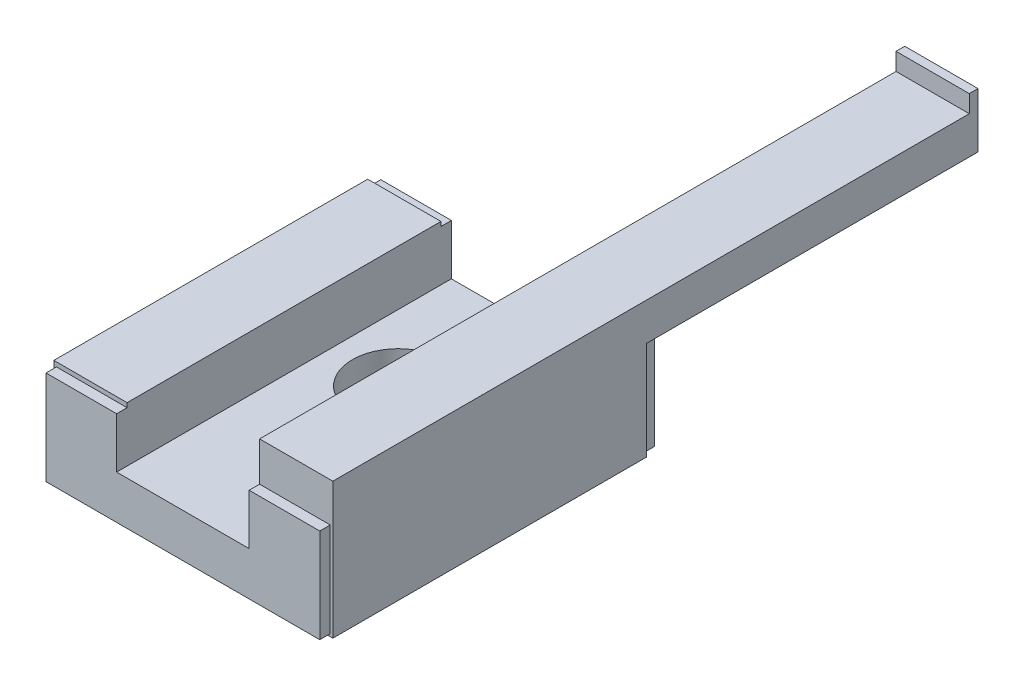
ISO-10303-21;
HEADER;
FILE_DESCRIPTION(('STEP AP214'),'2;1');
FILE_NAME('part.step','',(''),(''),'','','');
FILE_SCHEMA(('AUTOMOTIVE_DESIGN { 1 0 10303 214 1 1 1 1 }'));
ENDSEC;
DATA;
#1=APPLICATION_CONTEXT('core data for automotive mechanical design processes');
#2=APPLICATION_PROTOCOL_DEFINITION('international standard','automotive_design',2000,#1);
#3=PRODUCT_CONTEXT('',#1,'mechanical');
#4=PRODUCT('Part','Part','',(#3));
#5=PRODUCT_RELATED_PRODUCT_CATEGORY('part','',(#4));
#6=PRODUCT_DEFINITION_FORMATION('','',#4);
#7=PRODUCT_DEFINITION_CONTEXT('part definition',#1,'design');
#8=PRODUCT_DEFINITION('design','',#6,#7);
#9=PRODUCT_DEFINITION_SHAPE('','',#8);
#10=(LENGTH_UNIT() NAMED_UNIT(*) SI_UNIT(.MILLI.,.METRE.));
#11=(NAMED_UNIT(*) PLANE_ANGLE_UNIT() SI_UNIT($,.RADIAN.));
#12=(NAMED_UNIT(*) SI_UNIT($,.STERADIAN.) SOLID_ANGLE_UNIT());
#13=UNCERTAINTY_MEASURE_WITH_UNIT(LENGTH_MEASURE(1.E-05),#10,'distance_accuracy_value','');
#14=(GEOMETRIC_REPRESENTATION_CONTEXT(3) GLOBAL_UNCERTAINTY_ASSIGNED_CONTEXT((#13)) GLOBAL_UNIT_ASSIGNED_CONTEXT((#10,
#11,#12)) REPRESENTATION_CONTEXT('',''));
#15=CARTESIAN_POINT('',(0.,0.,0.));
#16=DIRECTION('',(0.,0.,1.));
#17=DIRECTION('',(1.,0.,0.));
#18=AXIS2_PLACEMENT_3D('',#15,#16,#17);
#19=CARTESIAN_POINT('',(7.6,15.6,37.2));
#20=DIRECTION('',(0.,1.,0.));
#21=DIRECTION('',(1.,0.,0.));
#22=AXIS2_PLACEMENT_3D('',#19,#20,#21);
#23=PLANE('',#22);
#24=DIRECTION('',(-1.,0.,0.));
#25=VECTOR('',#24,1.);
#26=CARTESIAN_POINT('',(16.,15.6,-35.8));
#27=LINE('',#26,#25);
#28=CARTESIAN_POINT('',(7.6,15.6,-35.8));
#29=VERTEX_POINT('',#28);
#30=CARTESIAN_POINT('',(16.,15.6,-35.8));
#31=VERTEX_POINT('',#30);
#32=EDGE_CURVE('E197',#29,#31,#27,.F.);
#33=ORIENTED_EDGE('',*,*,#32,.F.);
#34=DIRECTION('',(0.,0.,1.));
#35=VECTOR('',#34,1.);
#36=CARTESIAN_POINT('',(7.6,15.6,-35.8));
#37=LINE('',#36,#35);
#38=CARTESIAN_POINT('',(7.6,15.6,37.2));
#39=VERTEX_POINT('',#38);
#40=EDGE_CURVE('E212',#39,#29,#37,.F.);
#41=ORIENTED_EDGE('',*,*,#40,.F.);
#42=DIRECTION('',(1.,0.,0.));
#43=VECTOR('',#42,1.);
#44=CARTESIAN_POINT('',(7.6,15.6,37.2));
#45=LINE('',#44,#43);
#46=CARTESIAN_POINT('',(16.,15.6,37.2));
#47=VERTEX_POINT('',#46);
#48=EDGE_CURVE('E221',#47,#39,#45,.F.);
#49=ORIENTED_EDGE('',*,*,#48,.F.);
#50=DIRECTION('',(0.,0.,-1.));
#51=VECTOR('',#50,1.);
#52=CARTESIAN_POINT('',(16.,15.6,37.2));
#53=LINE('',#52,#51);
#54=EDGE_CURVE('E214',#47,#31,#53,.T.);
#55=ORIENTED_EDGE('',*,*,#54,.T.);
#56=EDGE_LOOP('',(#33,#41,#49,#55));
#57=FACE_BOUND('',#56,.T.);
#58=ADVANCED_FACE('F16',(#57),#23,.T.);
#59=CARTESIAN_POINT('',(-16.,11.6,37.2));
#60=DIRECTION('',(0.,1.,0.));
#61=DIRECTION('',(1.,0.,0.));
#62=AXIS2_PLACEMENT_3D('',#59,#60,#61);
#63=PLANE('',#62);
#64=DIRECTION('',(1.,0.,0.));
#65=VECTOR('',#64,1.);
#66=CARTESIAN_POINT('',(-16.,11.6,37.2));
#67=LINE('',#66,#65);
#68=CARTESIAN_POINT('',(-7.6,11.6,37.2));
#69=VERTEX_POINT('',#68);
#70=CARTESIAN_POINT('',(-16.,11.6,37.2));
#71=VERTEX_POINT('',#70);
#72=EDGE_CURVE('E232',#69,#71,#67,.F.);
#73=ORIENTED_EDGE('',*,*,#72,.F.);
#74=DIRECTION('',(0.,0.,-1.));
#75=VECTOR('',#74,1.);
#76=CARTESIAN_POINT('',(-7.6,11.6,37.2));
#77=LINE('',#76,#75);
#78=CARTESIAN_POINT('',(-7.6,11.6,1.2));
#79=VERTEX_POINT('',#78);
#80=EDGE_CURVE('E236',#69,#79,#77,.T.);
#81=ORIENTED_EDGE('',*,*,#80,.T.);
#82=DIRECTION('',(-1.,0.,0.));
#83=VECTOR('',#82,1.);
#84=CARTESIAN_POINT('',(-7.6,11.6,1.2));
#85=LINE('',#84,#83);
#86=CARTESIAN_POINT('',(-16.,11.6,1.2));
#87=VERTEX_POINT('',#86);
#88=EDGE_CURVE('E241',#79,#87,#85,.T.);
#89=ORIENTED_EDGE('',*,*,#88,.T.);
#90=DIRECTION('',(0.,0.,1.));
#91=VECTOR('',#90,1.);
#92=CARTESIAN_POINT('',(-16.,11.6,1.2));
#93=LINE('',#92,#91);
#94=EDGE_CURVE('E246',#71,#87,#93,.F.);
#95=ORIENTED_EDGE('',*,*,#94,.F.);
#96=EDGE_LOOP('',(#73,#81,#89,#95));
#97=FACE_BOUND('',#96,.T.);
#98=ADVANCED_FACE('F638',(#97),#63,.T.);
#99=CARTESIAN_POINT('',(-16.,0.,37.2));
#100=DIRECTION('',(-1.,0.,0.));
#101=DIRECTION('',(0.,1.,0.));
#102=AXIS2_PLACEMENT_3D('',#99,#100,#101);
#103=PLANE('',#102);
#104=DIRECTION('',(0.,1.,0.));
#105=VECTOR('',#104,1.);
#106=CARTESIAN_POINT('',(-16.,0.,37.2));
#107=LINE('',#106,#105);
#108=CARTESIAN_POINT('',(-16.,0.,37.2));
#109=VERTEX_POINT('',#108);
#110=EDGE_CURVE('E251',#71,#109,#107,.F.);
#111=ORIENTED_EDGE('',*,*,#110,.F.);
#112=ORIENTED_EDGE('',*,*,#94,.T.);
#113=DIRECTION('',(0.,-1.,0.));
#114=VECTOR('',#113,1.);
#115=CARTESIAN_POINT('',(-16.,11.6,1.2));
#116=LINE('',#115,#114);
#117=CARTESIAN_POINT('',(-16.,0.,1.2));
#118=VERTEX_POINT('',#117);
#119=EDGE_CURVE('E255',#87,#118,#116,.T.);
#120=ORIENTED_EDGE('',*,*,#119,.T.);
#121=DIRECTION('',(0.,0.,1.));
#122=VECTOR('',#121,1.);
#123=CARTESIAN_POINT('',(-16.,0.,1.2));
#124=LINE('',#123,#122);
#125=EDGE_CURVE('E260',#109,#118,#124,.F.);
#126=ORIENTED_EDGE('',*,*,#125,.F.);
#127=EDGE_LOOP('',(#111,#112,#120,#126));
#128=FACE_BOUND('',#127,.T.);
#129=ADVANCED_FACE('F643',(#128),#103,.T.);
#130=CARTESIAN_POINT('',(-16.,0.,1.2));
#131=DIRECTION('',(0.,-1.,0.));
#132=DIRECTION('',(1.,0.,0.));
#133=AXIS2_PLACEMENT_3D('',#130,#131,#132);
#134=PLANE('',#133);
#135=DIRECTION('',(-1.,0.,0.));
#136=VECTOR('',#135,1.);
#137=CARTESIAN_POINT('',(-8.,0.,37.2));
#138=LINE('',#137,#136);
#139=CARTESIAN_POINT('',(-8.,0.,37.2));
#140=VERTEX_POINT('',#139);
#141=EDGE_CURVE('E265',#109,#140,#138,.F.);
#142=ORIENTED_EDGE('',*,*,#141,.F.);
#143=ORIENTED_EDGE('',*,*,#125,.T.);
#144=DIRECTION('',(1.,0.,0.));
#145=VECTOR('',#144,1.);
#146=CARTESIAN_POINT('',(-16.,0.,1.2));
#147=LINE('',#146,#145);
#148=CARTESIAN_POINT('',(-8.,0.,1.2));
#149=VERTEX_POINT('',#148);
#150=EDGE_CURVE('E269',#118,#149,#147,.T.);
#151=ORIENTED_EDGE('',*,*,#150,.T.);
#152=DIRECTION('',(0.,0.,1.));
#153=VECTOR('',#152,1.);
#154=CARTESIAN_POINT('',(-8.,0.,1.2));
#155=LINE('',#154,#153);
#156=EDGE_CURVE('E274',#140,#149,#155,.F.);
#157=ORIENTED_EDGE('',*,*,#156,.F.);
#158=EDGE_LOOP('',(#142,#143,#151,#157));
#159=FACE_BOUND('',#158,.T.);
#160=CARTESIAN_POINT('',(-12.,0.,9.2));
#161=DIRECTION('',(0.,1.,0.));
#162=DIRECTION('',(0.,0.,-1.));
#163=AXIS2_PLACEMENT_3D('',#160,#161,#162);
#164=CIRCLE('',#163,2.);
#165=CARTESIAN_POINT('',(-12.,0.,7.2));
#166=VERTEX_POINT('',#165);
#167=EDGE_CURVE('E279',#166,#166,#164,.F.);
#168=ORIENTED_EDGE('',*,*,#167,.F.);
#169=EDGE_LOOP('',(#168));
#170=FACE_BOUND('',#169,.T.);
#171=CARTESIAN_POINT('',(-12.,0.,29.2));
#172=DIRECTION('',(0.,1.,0.));
#173=DIRECTION('',(0.,0.,-1.));
#174=AXIS2_PLACEMENT_3D('',#171,#172,#173);
#175=CIRCLE('',#174,2.);
#176=CARTESIAN_POINT('',(-12.,0.,27.2));
#177=VERTEX_POINT('',#176);
#178=EDGE_CURVE('E284',#177,#177,#175,.F.);
#179=ORIENTED_EDGE('',*,*,#178,.F.);
#180=EDGE_LOOP('',(#179));
#181=FACE_BOUND('',#180,.T.);
#182=ADVANCED_FACE('F649',(#159,#170,#181),#134,.T.);
#183=CARTESIAN_POINT('',(-7.7,0.300000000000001,1.2));
#184=DIRECTION('',(0.707106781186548,-0.707106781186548,0.));
#185=DIRECTION('',(0.,0.,1.));
#186=AXIS2_PLACEMENT_3D('',#183,#184,#185);
#187=PLANE('',#186);
#188=DIRECTION('',(-0.707106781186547,-0.707106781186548,0.));
#189=VECTOR('',#188,1.);
#190=CARTESIAN_POINT('',(-7.7,0.299999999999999,37.2));
#191=LINE('',#190,#189);
#192=CARTESIAN_POINT('',(-7.7,0.299999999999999,37.2));
#193=VERTEX_POINT('',#192);
#194=EDGE_CURVE('E287',#140,#193,#191,.F.);
#195=ORIENTED_EDGE('',*,*,#194,.F.);
#196=ORIENTED_EDGE('',*,*,#156,.T.);
#197=DIRECTION('',(0.707106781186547,0.707106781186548,0.));
#198=VECTOR('',#197,1.);
#199=CARTESIAN_POINT('',(-8.,0.,1.2));
#200=LINE('',#199,#198);
#201=CARTESIAN_POINT('',(-7.7,0.300000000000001,1.2));
#202=VERTEX_POINT('',#201);
#203=EDGE_CURVE('E289',#149,#202,#200,.T.);
#204=ORIENTED_EDGE('',*,*,#203,.T.);
#205=DIRECTION('',(0.,0.,1.));
#206=VECTOR('',#205,1.);
#207=CARTESIAN_POINT('',(-7.7,0.300000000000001,1.2));
#208=LINE('',#207,#206);
#209=EDGE_CURVE('E294',#193,#202,#208,.F.);
#210=ORIENTED_EDGE('',*,*,#209,.F.);
#211=EDGE_LOOP('',(#195,#196,#204,#210));
#212=FACE_BOUND('',#211,.T.);
#213=ADVANCED_FACE('F653',(#212),#187,.T.);
#214=CARTESIAN_POINT('',(8.,0.,1.2));
#215=DIRECTION('',(-0.707106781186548,-0.707106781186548,0.));
#216=DIRECTION('',(0.,0.,1.));
#217=AXIS2_PLACEMENT_3D('',#214,#215,#216);
#218=PLANE('',#217);
#219=DIRECTION('',(-0.707106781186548,0.707106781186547,0.));
#220=VECTOR('',#219,1.);
#221=CARTESIAN_POINT('',(8.,0.,37.2));
#222=LINE('',#221,#220);
#223=CARTESIAN_POINT('',(7.7,0.3,37.2));
#224=VERTEX_POINT('',#223);
#225=CARTESIAN_POINT('',(8.,0.,37.2));
#226=VERTEX_POINT('',#225);
#227=EDGE_CURVE('E299',#224,#226,#222,.F.);
#228=ORIENTED_EDGE('',*,*,#227,.F.);
#229=DIRECTION('',(0.,0.,-1.));
#230=VECTOR('',#229,1.);
#231=CARTESIAN_POINT('',(7.7,0.3,37.2));
#232=LINE('',#231,#230);
#233=CARTESIAN_POINT('',(7.7,0.3,1.20000000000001));
#234=VERTEX_POINT('',#233);
#235=EDGE_CURVE('E303',#224,#234,#232,.T.);
#236=ORIENTED_EDGE('',*,*,#235,.T.);
#237=DIRECTION('',(0.707106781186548,-0.707106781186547,0.));
#238=VECTOR('',#237,1.);
#239=CARTESIAN_POINT('',(7.7,0.3,1.2));
#240=LINE('',#239,#238);
#241=CARTESIAN_POINT('',(8.,0.,1.2));
#242=VERTEX_POINT('',#241);
#243=EDGE_CURVE('E308',#234,#242,#240,.T.);
#244=ORIENTED_EDGE('',*,*,#243,.T.);
#245=DIRECTION('',(0.,0.,1.));
#246=VECTOR('',#245,1.);
#247=CARTESIAN_POINT('',(8.,0.,1.2));
#248=LINE('',#247,#246);
#249=EDGE_CURVE('E313',#226,#242,#248,.F.);
#250=ORIENTED_EDGE('',*,*,#249,.F.);
#251=EDGE_LOOP('',(#228,#236,#244,#250));
#252=FACE_BOUND('',#251,.T.);
#253=ADVANCED_FACE('F657',(#252),#218,.T.);
#254=CARTESIAN_POINT('',(8.,0.,1.2));
#255=DIRECTION('',(0.,-1.,0.));
#256=DIRECTION('',(1.,0.,0.));
#257=AXIS2_PLACEMENT_3D('',#254,#255,#256);
#258=PLANE('',#257);
#259=DIRECTION('',(-1.,0.,0.));
#260=VECTOR('',#259,1.);
#261=CARTESIAN_POINT('',(16.,0.,37.2));
#262=LINE('',#261,#260);
#263=CARTESIAN_POINT('',(16.,0.,37.2));
#264=VERTEX_POINT('',#263);
#265=EDGE_CURVE('E318',#226,#264,#262,.F.);
#266=ORIENTED_EDGE('',*,*,#265,.F.);
#267=ORIENTED_EDGE('',*,*,#249,.T.);
#268=DIRECTION('',(1.,0.,0.));
#269=VECTOR('',#268,1.);
#270=CARTESIAN_POINT('',(8.,0.,1.2));
#271=LINE('',#270,#269);
#272=CARTESIAN_POINT('',(16.,0.,1.2));
#273=VERTEX_POINT('',#272);
#274=EDGE_CURVE('E322',#242,#273,#271,.T.);
#275=ORIENTED_EDGE('',*,*,#274,.T.);
#276=DIRECTION('',(0.,0.,1.));
#277=VECTOR('',#276,1.);
#278=CARTESIAN_POINT('',(16.,0.,1.2));
#279=LINE('',#278,#277);
#280=EDGE_CURVE('E327',#264,#273,#279,.F.);
#281=ORIENTED_EDGE('',*,*,#280,.F.);
#282=EDGE_LOOP('',(#266,#267,#275,#281));
#283=FACE_BOUND('',#282,.T.);
#284=CARTESIAN_POINT('',(12.,0.,9.2));
#285=DIRECTION('',(0.,1.,0.));
#286=DIRECTION('',(0.,0.,-1.));
#287=AXIS2_PLACEMENT_3D('',#284,#285,#286);
#288=CIRCLE('',#287,2.);
#289=CARTESIAN_POINT('',(12.,0.,7.2));
#290=VERTEX_POINT('',#289);
#291=EDGE_CURVE('E332',#290,#290,#288,.F.);
#292=ORIENTED_EDGE('',*,*,#291,.F.);
#293=EDGE_LOOP('',(#292));
#294=FACE_BOUND('',#293,.T.);
#295=CARTESIAN_POINT('',(12.,0.,29.2));
#296=DIRECTION('',(0.,1.,0.));
#297=DIRECTION('',(0.,0.,-1.));
#298=AXIS2_PLACEMENT_3D('',#295,#296,#297);
#299=CIRCLE('',#298,2.);
#300=CARTESIAN_POINT('',(12.,0.,27.2));
#301=VERTEX_POINT('',#300);
#302=EDGE_CURVE('E337',#301,#301,#299,.F.);
#303=ORIENTED_EDGE('',*,*,#302,.F.);
#304=EDGE_LOOP('',(#303));
#305=FACE_BOUND('',#304,.T.);
#306=ADVANCED_FACE('F661',(#283,#294,#305),#258,.T.);
#307=CARTESIAN_POINT('',(16.,0.,-36.8));
#308=DIRECTION('',(1.,0.,0.));
#309=DIRECTION('',(0.,1.,0.));
#310=AXIS2_PLACEMENT_3D('',#307,#308,#309);
#311=PLANE('',#310);
#312=DIRECTION('',(0.,-1.,0.));
#313=VECTOR('',#312,1.);
#314=CARTESIAN_POINT('',(16.,15.6,37.2));
#315=LINE('',#314,#313);
#316=EDGE_CURVE('E340',#264,#47,#315,.F.);
#317=ORIENTED_EDGE('',*,*,#316,.F.);
#318=ORIENTED_EDGE('',*,*,#280,.T.);
#319=DIRECTION('',(0.,1.,0.));
#320=VECTOR('',#319,1.);
#321=CARTESIAN_POINT('',(16.,0.,1.2));
#322=LINE('',#321,#320);
#323=CARTESIAN_POINT('',(16.,11.3,1.2));
#324=VERTEX_POINT('',#323);
#325=EDGE_CURVE('E342',#273,#324,#322,.T.);
#326=ORIENTED_EDGE('',*,*,#325,.T.);
#327=DIRECTION('',(0.,0.,-1.));
#328=VECTOR('',#327,1.);
#329=CARTESIAN_POINT('',(16.,11.3,1.2));
#330=LINE('',#329,#328);
#331=CARTESIAN_POINT('',(16.,11.3,-36.8));
#332=VERTEX_POINT('',#331);
#333=EDGE_CURVE('E347',#332,#324,#330,.F.);
#334=ORIENTED_EDGE('',*,*,#333,.F.);
#335=DIRECTION('',(0.,1.,0.));
#336=VECTOR('',#335,1.);
#337=CARTESIAN_POINT('',(16.,11.3,-36.8));
#338=LINE('',#337,#336);
#339=CARTESIAN_POINT('',(16.,17.6,-36.8));
#340=VERTEX_POINT('',#339);
#341=EDGE_CURVE('E351',#332,#340,#338,.T.);
#342=ORIENTED_EDGE('',*,*,#341,.T.);
#343=DIRECTION('',(0.,0.,1.));
#344=VECTOR('',#343,1.);
#345=CARTESIAN_POINT('',(16.,17.6,-36.8));
#346=LINE('',#345,#344);
#347=CARTESIAN_POINT('',(16.,17.6,-35.8));
#348=VERTEX_POINT('',#347);
#349=EDGE_CURVE('E356',#348,#340,#346,.F.);
#350=ORIENTED_EDGE('',*,*,#349,.F.);
#351=DIRECTION('',(0.,-1.,0.));
#352=VECTOR('',#351,1.);
#353=CARTESIAN_POINT('',(16.,17.6,-35.8));
#354=LINE('',#353,#352);
#355=EDGE_CURVE('E360',#31,#348,#354,.F.);
#356=ORIENTED_EDGE('',*,*,#355,.F.);
#357=ORIENTED_EDGE('',*,*,#54,.F.);
#358=EDGE_LOOP('',(#317,#318,#326,#334,#342,#350,#356,#357));
#359=FACE_BOUND('',#358,.T.);
#360=ADVANCED_FACE('F665',(#359),#311,.T.);
#361=CARTESIAN_POINT('',(7.6,5.3,38.4));
#362=DIRECTION('',(-1.,0.,0.));
#363=DIRECTION('',(0.,1.,0.));
#364=AXIS2_PLACEMENT_3D('',#361,#362,#363);
#365=PLANE('',#364);
#366=DIRECTION('',(0.,0.,1.));
#367=VECTOR('',#366,1.);
#368=CARTESIAN_POINT('',(7.6,11.3,-36.8));
#369=LINE('',#368,#367);
#370=CARTESIAN_POINT('',(7.6,11.3,-36.8));
#371=VERTEX_POINT('',#370);
#372=CARTESIAN_POINT('',(7.6,11.3,0.));
#373=VERTEX_POINT('',#372);
#374=EDGE_CURVE('E364',#371,#373,#369,.T.);
#375=ORIENTED_EDGE('',*,*,#374,.T.);
#376=DIRECTION('',(0.,-1.,0.));
#377=VECTOR('',#376,1.);
#378=CARTESIAN_POINT('',(7.6,11.3,0.));
#379=LINE('',#378,#377);
#380=CARTESIAN_POINT('',(7.6,5.3,0.));
#381=VERTEX_POINT('',#380);
#382=EDGE_CURVE('E368',#373,#381,#379,.T.);
#383=ORIENTED_EDGE('',*,*,#382,.T.);
#384=DIRECTION('',(0.,0.,1.));
#385=VECTOR('',#384,1.);
#386=CARTESIAN_POINT('',(7.6,5.3,0.));
#387=LINE('',#386,#385);
#388=CARTESIAN_POINT('',(7.6,5.3,38.4));
#389=VERTEX_POINT('',#388);
#390=EDGE_CURVE('E373',#389,#381,#387,.F.);
#391=ORIENTED_EDGE('',*,*,#390,.F.);
#392=DIRECTION('',(0.,1.,0.));
#393=VECTOR('',#392,1.);
#394=CARTESIAN_POINT('',(7.6,5.3,38.4));
#395=LINE('',#394,#393);
#396=CARTESIAN_POINT('',(7.6,11.1,38.4));
#397=VERTEX_POINT('',#396);
#398=EDGE_CURVE('E377',#397,#389,#395,.F.);
#399=ORIENTED_EDGE('',*,*,#398,.F.);
#400=DIRECTION('',(0.,0.,-1.));
#401=VECTOR('',#400,1.);
#402=CARTESIAN_POINT('',(7.6,11.1,38.4));
#403=LINE('',#402,#401);
#404=CARTESIAN_POINT('',(7.6,11.1,37.2));
#405=VERTEX_POINT('',#404);
#406=EDGE_CURVE('E381',#405,#397,#403,.F.);
#407=ORIENTED_EDGE('',*,*,#406,.F.);
#408=DIRECTION('',(0.,1.,0.));
#409=VECTOR('',#408,1.);
#410=CARTESIAN_POINT('',(7.6,11.1,37.2));
#411=LINE('',#410,#409);
#412=EDGE_CURVE('E206',#39,#405,#411,.F.);
#413=ORIENTED_EDGE('',*,*,#412,.F.);
#414=ORIENTED_EDGE('',*,*,#40,.T.);
#415=DIRECTION('',(0.,1.,0.));
#416=VECTOR('',#415,1.);
#417=CARTESIAN_POINT('',(7.6,15.6,-35.8));
#418=LINE('',#417,#416);
#419=CARTESIAN_POINT('',(7.6,17.6,-35.8));
#420=VERTEX_POINT('',#419);
#421=EDGE_CURVE('E194',#420,#29,#418,.F.);
#422=ORIENTED_EDGE('',*,*,#421,.F.);
#423=DIRECTION('',(0.,0.,-1.));
#424=VECTOR('',#423,1.);
#425=CARTESIAN_POINT('',(7.6,17.6,-35.8));
#426=LINE('',#425,#424);
#427=CARTESIAN_POINT('',(7.6,17.6,-36.8));
#428=VERTEX_POINT('',#427);
#429=EDGE_CURVE('E205',#420,#428,#426,.T.);
#430=ORIENTED_EDGE('',*,*,#429,.T.);
#431=DIRECTION('',(0.,-1.,0.));
#432=VECTOR('',#431,1.);
#433=CARTESIAN_POINT('',(7.6,17.6,-36.8));
#434=LINE('',#433,#432);
#435=EDGE_CURVE('E393',#428,#371,#434,.T.);
#436=ORIENTED_EDGE('',*,*,#435,.T.);
#437=EDGE_LOOP('',(#375,#383,#391,#399,#407,#413,#414,#422,#430,#436));
#438=FACE_BOUND('',#437,.T.);
#439=ADVANCED_FACE('F218',(#438),#365,.T.);
#440=CARTESIAN_POINT('',(-7.6,5.3,0.));
#441=DIRECTION('',(1.,0.,0.));
#442=DIRECTION('',(0.,1.,0.));
#443=AXIS2_PLACEMENT_3D('',#440,#441,#442);
#444=PLANE('',#443);
#445=DIRECTION('',(0.,-1.,0.));
#446=VECTOR('',#445,1.);
#447=CARTESIAN_POINT('',(-7.6,11.6,37.2));
#448=LINE('',#447,#446);
#449=CARTESIAN_POINT('',(-7.6,11.1,37.2));
#450=VERTEX_POINT('',#449);
#451=EDGE_CURVE('E398',#450,#69,#448,.F.);
#452=ORIENTED_EDGE('',*,*,#451,.F.);
#453=DIRECTION('',(0.,0.,1.));
#454=VECTOR('',#453,1.);
#455=CARTESIAN_POINT('',(-7.6,11.1,37.2));
#456=LINE('',#455,#454);
#457=CARTESIAN_POINT('',(-7.6,11.1,38.4));
#458=VERTEX_POINT('',#457);
#459=EDGE_CURVE('E402',#450,#458,#456,.T.);
#460=ORIENTED_EDGE('',*,*,#459,.T.);
#461=DIRECTION('',(0.,-1.,0.));
#462=VECTOR('',#461,1.);
#463=CARTESIAN_POINT('',(-7.6,11.1,38.4));
#464=LINE('',#463,#462);
#465=CARTESIAN_POINT('',(-7.6,5.3,38.4));
#466=VERTEX_POINT('',#465);
#467=EDGE_CURVE('E407',#466,#458,#464,.F.);
#468=ORIENTED_EDGE('',*,*,#467,.F.);
#469=DIRECTION('',(0.,0.,-1.));
#470=VECTOR('',#469,1.);
#471=CARTESIAN_POINT('',(-7.6,5.3,38.4));
#472=LINE('',#471,#470);
#473=CARTESIAN_POINT('',(-7.6,5.3,0.));
#474=VERTEX_POINT('',#473);
#475=EDGE_CURVE('E412',#466,#474,#472,.T.);
#476=ORIENTED_EDGE('',*,*,#475,.T.);
#477=DIRECTION('',(0.,1.,0.));
#478=VECTOR('',#477,1.);
#479=CARTESIAN_POINT('',(-7.6,5.3,0.));
#480=LINE('',#479,#478);
#481=CARTESIAN_POINT('',(-7.6,11.1,0.));
#482=VERTEX_POINT('',#481);
#483=EDGE_CURVE('E417',#474,#482,#480,.T.);
#484=ORIENTED_EDGE('',*,*,#483,.T.);
#485=DIRECTION('',(0.,0.,1.));
#486=VECTOR('',#485,1.);
#487=CARTESIAN_POINT('',(-7.6,11.1,0.));
#488=LINE('',#487,#486);
#489=CARTESIAN_POINT('',(-7.6,11.1,1.2));
#490=VERTEX_POINT('',#489);
#491=EDGE_CURVE('E422',#490,#482,#488,.F.);
#492=ORIENTED_EDGE('',*,*,#491,.F.);
#493=DIRECTION('',(0.,1.,0.));
#494=VECTOR('',#493,1.);
#495=CARTESIAN_POINT('',(-7.6,11.1,1.2));
#496=LINE('',#495,#494);
#497=EDGE_CURVE('E426',#490,#79,#496,.T.);
#498=ORIENTED_EDGE('',*,*,#497,.T.);
#499=ORIENTED_EDGE('',*,*,#80,.F.);
#500=EDGE_LOOP('',(#452,#460,#468,#476,#484,#492,#498,#499));
#501=FACE_BOUND('',#500,.T.);
#502=ADVANCED_FACE('F672',(#501),#444,.T.);
#503=CARTESIAN_POINT('',(-15.7,0.3,0.));
#504=DIRECTION('',(0.,0.,-1.));
#505=DIRECTION('',(0.,1.,0.));
#506=AXIS2_PLACEMENT_3D('',#503,#504,#505);
#507=PLANE('',#506);
#508=ORIENTED_EDGE('',*,*,#382,.F.);
#509=DIRECTION('',(1.,0.,0.));
#510=VECTOR('',#509,1.);
#511=CARTESIAN_POINT('',(7.6,11.3,0.));
#512=LINE('',#511,#510);
#513=CARTESIAN_POINT('',(15.7,11.3,0.));
#514=VERTEX_POINT('',#513);
#515=EDGE_CURVE('E431',#373,#514,#512,.T.);
#516=ORIENTED_EDGE('',*,*,#515,.T.);
#517=DIRECTION('',(0.,-1.,0.));
#518=VECTOR('',#517,1.);
#519=CARTESIAN_POINT('',(15.7,11.3,0.));
#520=LINE('',#519,#518);
#521=CARTESIAN_POINT('',(15.7,0.300000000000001,0.));
#522=VERTEX_POINT('',#521);
#523=EDGE_CURVE('E436',#514,#522,#520,.T.);
#524=ORIENTED_EDGE('',*,*,#523,.T.);
#525=DIRECTION('',(-1.,0.,0.));
#526=VECTOR('',#525,1.);
#527=CARTESIAN_POINT('',(15.7,0.3,0.));
#528=LINE('',#527,#526);
#529=CARTESIAN_POINT('',(-15.7,0.3,0.));
#530=VERTEX_POINT('',#529);
#531=EDGE_CURVE('E441',#530,#522,#528,.F.);
#532=ORIENTED_EDGE('',*,*,#531,.F.);
#533=DIRECTION('',(0.,1.,0.));
#534=VECTOR('',#533,1.);
#535=CARTESIAN_POINT('',(-15.7,0.3,0.));
#536=LINE('',#535,#534);
#537=CARTESIAN_POINT('',(-15.7,11.1,0.));
#538=VERTEX_POINT('',#537);
#539=EDGE_CURVE('E446',#530,#538,#536,.T.);
#540=ORIENTED_EDGE('',*,*,#539,.T.);
#541=DIRECTION('',(1.,0.,0.));
#542=VECTOR('',#541,1.);
#543=CARTESIAN_POINT('',(-15.7,11.1,0.));
#544=LINE('',#543,#542);
#545=EDGE_CURVE('E451',#538,#482,#544,.T.);
#546=ORIENTED_EDGE('',*,*,#545,.T.);
#547=ORIENTED_EDGE('',*,*,#483,.F.);
#548=DIRECTION('',(1.,0.,0.));
#549=VECTOR('',#548,1.);
#550=CARTESIAN_POINT('',(-7.6,5.3,0.));
#551=LINE('',#550,#549);
#552=EDGE_CURVE('E456',#381,#474,#551,.F.);
#553=ORIENTED_EDGE('',*,*,#552,.F.);
#554=EDGE_LOOP('',(#508,#516,#524,#532,#540,#546,#547,#553));
#555=FACE_BOUND('',#554,.T.);
#556=ADVANCED_FACE('F675',(#555),#507,.T.);
#557=CARTESIAN_POINT('',(-15.7,0.3,0.));
#558=DIRECTION('',(0.,-1.,0.));
#559=DIRECTION('',(1.,0.,0.));
#560=AXIS2_PLACEMENT_3D('',#557,#558,#559);
#561=PLANE('',#560);
#562=DIRECTION('',(-1.,0.,0.));
#563=VECTOR('',#562,1.);
#564=CARTESIAN_POINT('',(15.7,0.3,38.4));
#565=LINE('',#564,#563);
#566=CARTESIAN_POINT('',(-15.7,0.3,38.4));
#567=VERTEX_POINT('',#566);
#568=CARTESIAN_POINT('',(15.7,0.3,38.4));
#569=VERTEX_POINT('',#568);
#570=EDGE_CURVE('E460',#567,#569,#565,.F.);
#571=ORIENTED_EDGE('',*,*,#570,.F.);
#572=DIRECTION('',(0.,0.,-1.));
#573=VECTOR('',#572,1.);
#574=CARTESIAN_POINT('',(-15.7,0.3,38.4));
#575=LINE('',#574,#573);
#576=CARTESIAN_POINT('',(-15.7,0.3,37.2));
#577=VERTEX_POINT('',#576);
#578=EDGE_CURVE('E465',#577,#567,#575,.F.);
#579=ORIENTED_EDGE('',*,*,#578,.F.);
#580=DIRECTION('',(1.,0.,0.));
#581=VECTOR('',#580,1.);
#582=CARTESIAN_POINT('',(-15.7,0.3,37.2));
#583=LINE('',#582,#581);
#584=EDGE_CURVE('E469',#193,#577,#583,.F.);
#585=ORIENTED_EDGE('',*,*,#584,.F.);
#586=ORIENTED_EDGE('',*,*,#209,.T.);
#587=DIRECTION('',(-1.,0.,0.));
#588=VECTOR('',#587,1.);
#589=CARTESIAN_POINT('',(-7.7,0.3,1.2));
#590=LINE('',#589,#588);
#591=CARTESIAN_POINT('',(-15.7,0.3,1.2));
#592=VERTEX_POINT('',#591);
#593=EDGE_CURVE('E473',#202,#592,#590,.T.);
#594=ORIENTED_EDGE('',*,*,#593,.T.);
#595=DIRECTION('',(0.,0.,-1.));
#596=VECTOR('',#595,1.);
#597=CARTESIAN_POINT('',(-15.7,0.3,1.2));
#598=LINE('',#597,#596);
#599=EDGE_CURVE('E478',#592,#530,#598,.T.);
#600=ORIENTED_EDGE('',*,*,#599,.T.);
#601=ORIENTED_EDGE('',*,*,#531,.T.);
#602=DIRECTION('',(0.,0.,1.));
#603=VECTOR('',#602,1.);
#604=CARTESIAN_POINT('',(15.7,0.3,0.));
#605=LINE('',#604,#603);
#606=CARTESIAN_POINT('',(15.7,0.3,1.2));
#607=VERTEX_POINT('',#606);
#608=EDGE_CURVE('E483',#607,#522,#605,.F.);
#609=ORIENTED_EDGE('',*,*,#608,.F.);
#610=DIRECTION('',(-1.,0.,0.));
#611=VECTOR('',#610,1.);
#612=CARTESIAN_POINT('',(15.7,0.3,1.2));
#613=LINE('',#612,#611);
#614=EDGE_CURVE('E487',#607,#234,#613,.T.);
#615=ORIENTED_EDGE('',*,*,#614,.T.);
#616=ORIENTED_EDGE('',*,*,#235,.F.);
#617=DIRECTION('',(1.,0.,0.));
#618=VECTOR('',#617,1.);
#619=CARTESIAN_POINT('',(7.7,0.3,37.2));
#620=LINE('',#619,#618);
#621=CARTESIAN_POINT('',(15.7,0.3,37.2));
#622=VERTEX_POINT('',#621);
#623=EDGE_CURVE('E492',#622,#224,#620,.F.);
#624=ORIENTED_EDGE('',*,*,#623,.F.);
#625=DIRECTION('',(0.,0.,1.));
#626=VECTOR('',#625,1.);
#627=CARTESIAN_POINT('',(15.7,0.3,37.2));
#628=LINE('',#627,#626);
#629=EDGE_CURVE('E496',#622,#569,#628,.T.);
#630=ORIENTED_EDGE('',*,*,#629,.T.);
#631=EDGE_LOOP('',(#571,#579,#585,#586,#594,#600,#601,#609,#615,#616,#624,#630));
#632=FACE_BOUND('',#631,.T.);
#633=CARTESIAN_POINT('',(0.,0.3,13.7));
#634=DIRECTION('',(0.,1.,0.));
#635=DIRECTION('',(0.,0.,-1.));
#636=AXIS2_PLACEMENT_3D('',#633,#634,#635);
#637=CIRCLE('',#636,5.25);
#638=CARTESIAN_POINT('',(0.,0.3,8.45));
#639=VERTEX_POINT('',#638);
#640=EDGE_CURVE('E501',#639,#639,#637,.F.);
#641=ORIENTED_EDGE('',*,*,#640,.F.);
#642=EDGE_LOOP('',(#641));
#643=FACE_BOUND('',#642,.T.);
#644=CARTESIAN_POINT('',(0.,0.3,29.2));
#645=DIRECTION('',(0.,1.,0.));
#646=DIRECTION('',(0.,0.,-1.));
#647=AXIS2_PLACEMENT_3D('',#644,#645,#646);
#648=CIRCLE('',#647,1.5);
#649=CARTESIAN_POINT('',(0.,0.3,27.7));
#650=VERTEX_POINT('',#649);
#651=EDGE_CURVE('E506',#650,#650,#648,.F.);
#652=ORIENTED_EDGE('',*,*,#651,.F.);
#653=EDGE_LOOP('',(#652));
#654=FACE_BOUND('',#653,.T.);
#655=ADVANCED_FACE('F679',(#632,#643,#654),#561,.T.);
#656=CARTESIAN_POINT('',(-7.6,5.3,38.4));
#657=DIRECTION('',(0.,1.,0.));
#658=DIRECTION('',(1.,0.,0.));
#659=AXIS2_PLACEMENT_3D('',#656,#657,#658);
#660=PLANE('',#659);
#661=ORIENTED_EDGE('',*,*,#552,.T.);
#662=ORIENTED_EDGE('',*,*,#475,.F.);
#663=DIRECTION('',(1.,0.,0.));
#664=VECTOR('',#663,1.);
#665=CARTESIAN_POINT('',(-7.6,5.3,38.4));
#666=LINE('',#665,#664);
#667=EDGE_CURVE('E509',#389,#466,#666,.F.);
#668=ORIENTED_EDGE('',*,*,#667,.F.);
#669=ORIENTED_EDGE('',*,*,#390,.T.);
#670=EDGE_LOOP('',(#661,#662,#668,#669));
#671=FACE_BOUND('',#670,.T.);
#672=CARTESIAN_POINT('',(0.,5.3,13.7));
#673=DIRECTION('',(0.,-1.,0.));
#674=DIRECTION('',(-1.42053916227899E-07,0.,0.99999999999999));
#675=AXIS2_PLACEMENT_3D('',#672,#673,#674);
#676=CIRCLE('',#675,5.25);
#677=CARTESIAN_POINT('',(-7.4578306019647E-07,5.3,18.9499999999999));
#678=VERTEX_POINT('',#677);
#679=EDGE_CURVE('E511',#678,#678,#676,.F.);
#680=ORIENTED_EDGE('',*,*,#679,.F.);
#681=EDGE_LOOP('',(#680));
#682=FACE_BOUND('',#681,.T.);
#683=ADVANCED_FACE('F683',(#671,#682),#660,.T.);
#684=CARTESIAN_POINT('',(-15.7,0.3,38.4));
#685=DIRECTION('',(0.,0.,1.));
#686=DIRECTION('',(1.,0.,0.));
#687=AXIS2_PLACEMENT_3D('',#684,#685,#686);
#688=PLANE('',#687);
#689=DIRECTION('',(-1.,0.,0.));
#690=VECTOR('',#689,1.);
#691=CARTESIAN_POINT('',(15.7,11.1,38.4));
#692=LINE('',#691,#690);
#693=CARTESIAN_POINT('',(15.7,11.1,38.4));
#694=VERTEX_POINT('',#693);
#695=EDGE_CURVE('E516',#397,#694,#692,.F.);
#696=ORIENTED_EDGE('',*,*,#695,.F.);
#697=ORIENTED_EDGE('',*,*,#398,.T.);
#698=ORIENTED_EDGE('',*,*,#667,.T.);
#699=ORIENTED_EDGE('',*,*,#467,.T.);
#700=DIRECTION('',(-1.,0.,0.));
#701=VECTOR('',#700,1.);
#702=CARTESIAN_POINT('',(-7.6,11.1,38.4));
#703=LINE('',#702,#701);
#704=CARTESIAN_POINT('',(-15.7,11.1,38.4));
#705=VERTEX_POINT('',#704);
#706=EDGE_CURVE('E519',#705,#458,#703,.F.);
#707=ORIENTED_EDGE('',*,*,#706,.F.);
#708=DIRECTION('',(0.,-1.,0.));
#709=VECTOR('',#708,1.);
#710=CARTESIAN_POINT('',(-15.7,11.1,38.4));
#711=LINE('',#710,#709);
#712=EDGE_CURVE('E523',#567,#705,#711,.F.);
#713=ORIENTED_EDGE('',*,*,#712,.F.);
#714=ORIENTED_EDGE('',*,*,#570,.T.);
#715=DIRECTION('',(0.,1.,0.));
#716=VECTOR('',#715,1.);
#717=CARTESIAN_POINT('',(15.7,0.300000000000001,38.4));
#718=LINE('',#717,#716);
#719=EDGE_CURVE('E527',#694,#569,#718,.F.);
#720=ORIENTED_EDGE('',*,*,#719,.F.);
#721=EDGE_LOOP('',(#696,#697,#698,#699,#707,#713,#714,#720));
#722=FACE_BOUND('',#721,.T.);
#723=ADVANCED_FACE('F687',(#722),#688,.T.);
#724=CARTESIAN_POINT('',(-15.7,11.1,0.));
#725=DIRECTION('',(0.,1.,0.));
#726=DIRECTION('',(0.,0.,1.));
#727=AXIS2_PLACEMENT_3D('',#724,#725,#726);
#728=PLANE('',#727);
#729=ORIENTED_EDGE('',*,*,#545,.F.);
#730=DIRECTION('',(0.,0.,1.));
#731=VECTOR('',#730,1.);
#732=CARTESIAN_POINT('',(-15.7,11.1,0.));
#733=LINE('',#732,#731);
#734=CARTESIAN_POINT('',(-15.7,11.1,1.2));
#735=VERTEX_POINT('',#734);
#736=EDGE_CURVE('E531',#735,#538,#733,.F.);
#737=ORIENTED_EDGE('',*,*,#736,.F.);
#738=DIRECTION('',(1.,0.,0.));
#739=VECTOR('',#738,1.);
#740=CARTESIAN_POINT('',(-15.7,11.1,1.2));
#741=LINE('',#740,#739);
#742=EDGE_CURVE('E535',#735,#490,#741,.T.);
#743=ORIENTED_EDGE('',*,*,#742,.T.);
#744=ORIENTED_EDGE('',*,*,#491,.T.);
#745=EDGE_LOOP('',(#729,#737,#743,#744));
#746=FACE_BOUND('',#745,.T.);
#747=ADVANCED_FACE('F691',(#746),#728,.T.);
#748=CARTESIAN_POINT('',(-15.7,0.3,0.));
#749=DIRECTION('',(-1.,0.,0.));
#750=DIRECTION('',(0.,0.,1.));
#751=AXIS2_PLACEMENT_3D('',#748,#749,#750);
#752=PLANE('',#751);
#753=ORIENTED_EDGE('',*,*,#539,.F.);
#754=ORIENTED_EDGE('',*,*,#599,.F.);
#755=DIRECTION('',(0.,1.,0.));
#756=VECTOR('',#755,1.);
#757=CARTESIAN_POINT('',(-15.7,0.3,1.2));
#758=LINE('',#757,#756);
#759=EDGE_CURVE('E540',#592,#735,#758,.T.);
#760=ORIENTED_EDGE('',*,*,#759,.T.);
#761=ORIENTED_EDGE('',*,*,#736,.T.);
#762=EDGE_LOOP('',(#753,#754,#760,#761));
#763=FACE_BOUND('',#762,.T.);
#764=ADVANCED_FACE('F695',(#763),#752,.T.);
#765=CARTESIAN_POINT('',(-16.,0.,1.2));
#766=DIRECTION('',(0.,0.,-1.));
#767=DIRECTION('',(0.,1.,0.));
#768=AXIS2_PLACEMENT_3D('',#765,#766,#767);
#769=PLANE('',#768);
#770=ORIENTED_EDGE('',*,*,#150,.F.);
#771=ORIENTED_EDGE('',*,*,#119,.F.);
#772=ORIENTED_EDGE('',*,*,#88,.F.);
#773=ORIENTED_EDGE('',*,*,#497,.F.);
#774=ORIENTED_EDGE('',*,*,#742,.F.);
#775=ORIENTED_EDGE('',*,*,#759,.F.);
#776=ORIENTED_EDGE('',*,*,#593,.F.);
#777=ORIENTED_EDGE('',*,*,#203,.F.);
#778=EDGE_LOOP('',(#770,#771,#772,#773,#774,#775,#776,#777));
#779=FACE_BOUND('',#778,.T.);
#780=ADVANCED_FACE('F699',(#779),#769,.T.);
#781=CARTESIAN_POINT('',(7.7,0.,1.2));
#782=DIRECTION('',(0.,0.,-1.));
#783=DIRECTION('',(0.,1.,0.));
#784=AXIS2_PLACEMENT_3D('',#781,#782,#783);
#785=PLANE('',#784);
#786=DIRECTION('',(0.,1.,0.));
#787=VECTOR('',#786,1.);
#788=CARTESIAN_POINT('',(15.7,0.300000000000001,1.2));
#789=LINE('',#788,#787);
#790=CARTESIAN_POINT('',(15.7,11.3,1.2));
#791=VERTEX_POINT('',#790);
#792=EDGE_CURVE('E545',#791,#607,#789,.F.);
#793=ORIENTED_EDGE('',*,*,#792,.F.);
#794=DIRECTION('',(1.,0.,0.));
#795=VECTOR('',#794,1.);
#796=CARTESIAN_POINT('',(15.7,11.3,1.2));
#797=LINE('',#796,#795);
#798=EDGE_CURVE('E549',#791,#324,#797,.T.);
#799=ORIENTED_EDGE('',*,*,#798,.T.);
#800=ORIENTED_EDGE('',*,*,#325,.F.);
#801=ORIENTED_EDGE('',*,*,#274,.F.);
#802=ORIENTED_EDGE('',*,*,#243,.F.);
#803=ORIENTED_EDGE('',*,*,#614,.F.);
#804=EDGE_LOOP('',(#793,#799,#800,#801,#802,#803));
#805=FACE_BOUND('',#804,.T.);
#806=ADVANCED_FACE('F703',(#805),#785,.T.);
#807=CARTESIAN_POINT('',(15.7,0.3,1.2));
#808=DIRECTION('',(1.,0.,0.));
#809=DIRECTION('',(0.,0.,-1.));
#810=AXIS2_PLACEMENT_3D('',#807,#808,#809);
#811=PLANE('',#810);
#812=DIRECTION('',(0.,0.,1.));
#813=VECTOR('',#812,1.);
#814=CARTESIAN_POINT('',(15.7,11.3,0.));
#815=LINE('',#814,#813);
#816=EDGE_CURVE('E554',#791,#514,#815,.F.);
#817=ORIENTED_EDGE('',*,*,#816,.F.);
#818=ORIENTED_EDGE('',*,*,#792,.T.);
#819=ORIENTED_EDGE('',*,*,#608,.T.);
#820=ORIENTED_EDGE('',*,*,#523,.F.);
#821=EDGE_LOOP('',(#817,#818,#819,#820));
#822=FACE_BOUND('',#821,.T.);
#823=ADVANCED_FACE('F707',(#822),#811,.T.);
#824=CARTESIAN_POINT('',(-15.7,11.1,38.4));
#825=DIRECTION('',(0.,1.,0.));
#826=DIRECTION('',(1.,0.,0.));
#827=AXIS2_PLACEMENT_3D('',#824,#825,#826);
#828=PLANE('',#827);
#829=ORIENTED_EDGE('',*,*,#706,.T.);
#830=ORIENTED_EDGE('',*,*,#459,.F.);
#831=DIRECTION('',(-1.,0.,0.));
#832=VECTOR('',#831,1.);
#833=CARTESIAN_POINT('',(-7.6,11.1,37.2));
#834=LINE('',#833,#832);
#835=CARTESIAN_POINT('',(-15.7,11.1,37.2));
#836=VERTEX_POINT('',#835);
#837=EDGE_CURVE('E558',#836,#450,#834,.F.);
#838=ORIENTED_EDGE('',*,*,#837,.F.);
#839=DIRECTION('',(0.,0.,1.));
#840=VECTOR('',#839,1.);
#841=CARTESIAN_POINT('',(-15.7,11.1,37.2));
#842=LINE('',#841,#840);
#843=EDGE_CURVE('E562',#836,#705,#842,.T.);
#844=ORIENTED_EDGE('',*,*,#843,.T.);
#845=EDGE_LOOP('',(#829,#830,#838,#844));
#846=FACE_BOUND('',#845,.T.);
#847=ADVANCED_FACE('F711',(#846),#828,.T.);
#848=CARTESIAN_POINT('',(-15.7,0.3,38.4));
#849=DIRECTION('',(-1.,0.,0.));
#850=DIRECTION('',(0.,1.,0.));
#851=AXIS2_PLACEMENT_3D('',#848,#849,#850);
#852=PLANE('',#851);
#853=ORIENTED_EDGE('',*,*,#712,.T.);
#854=ORIENTED_EDGE('',*,*,#843,.F.);
#855=DIRECTION('',(0.,-1.,0.));
#856=VECTOR('',#855,1.);
#857=CARTESIAN_POINT('',(-15.7,11.1,37.2));
#858=LINE('',#857,#856);
#859=EDGE_CURVE('E39',#577,#836,#858,.F.);
#860=ORIENTED_EDGE('',*,*,#859,.F.);
#861=ORIENTED_EDGE('',*,*,#578,.T.);
#862=EDGE_LOOP('',(#853,#854,#860,#861));
#863=FACE_BOUND('',#862,.T.);
#864=ADVANCED_FACE('F715',(#863),#852,.T.);
#865=CARTESIAN_POINT('',(-16.,0.,37.2));
#866=DIRECTION('',(0.,0.,1.));
#867=DIRECTION('',(1.,0.,0.));
#868=AXIS2_PLACEMENT_3D('',#865,#866,#867);
#869=PLANE('',#868);
#870=ORIENTED_EDGE('',*,*,#194,.T.);
#871=ORIENTED_EDGE('',*,*,#584,.T.);
#872=ORIENTED_EDGE('',*,*,#859,.T.);
#873=ORIENTED_EDGE('',*,*,#837,.T.);
#874=ORIENTED_EDGE('',*,*,#451,.T.);
#875=ORIENTED_EDGE('',*,*,#72,.T.);
#876=ORIENTED_EDGE('',*,*,#110,.T.);
#877=ORIENTED_EDGE('',*,*,#141,.T.);
#878=EDGE_LOOP('',(#870,#871,#872,#873,#874,#875,#876,#877));
#879=FACE_BOUND('',#878,.T.);
#880=ADVANCED_FACE('F719',(#879),#869,.T.);
#881=CARTESIAN_POINT('',(7.6,0.,37.2));
#882=DIRECTION('',(0.,0.,1.));
#883=DIRECTION('',(1.,0.,0.));
#884=AXIS2_PLACEMENT_3D('',#881,#882,#883);
#885=PLANE('',#884);
#886=ORIENTED_EDGE('',*,*,#227,.T.);
#887=ORIENTED_EDGE('',*,*,#265,.T.);
#888=ORIENTED_EDGE('',*,*,#316,.T.);
#889=ORIENTED_EDGE('',*,*,#48,.T.);
#890=ORIENTED_EDGE('',*,*,#412,.T.);
#891=DIRECTION('',(1.,0.,0.));
#892=VECTOR('',#891,1.);
#893=CARTESIAN_POINT('',(7.6,11.1,37.2));
#894=LINE('',#893,#892);
#895=CARTESIAN_POINT('',(15.7,11.1,37.2));
#896=VERTEX_POINT('',#895);
#897=EDGE_CURVE('E570',#405,#896,#894,.T.);
#898=ORIENTED_EDGE('',*,*,#897,.T.);
#899=DIRECTION('',(0.,-1.,0.));
#900=VECTOR('',#899,1.);
#901=CARTESIAN_POINT('',(15.7,11.1,37.2));
#902=LINE('',#901,#900);
#903=EDGE_CURVE('E31',#896,#622,#902,.T.);
#904=ORIENTED_EDGE('',*,*,#903,.T.);
#905=ORIENTED_EDGE('',*,*,#623,.T.);
#906=EDGE_LOOP('',(#886,#887,#888,#889,#890,#898,#904,#905));
#907=FACE_BOUND('',#906,.T.);
#908=ADVANCED_FACE('F723',(#907),#885,.T.);
#909=CARTESIAN_POINT('',(7.6,11.1,38.4));
#910=DIRECTION('',(0.,1.,0.));
#911=DIRECTION('',(1.,0.,0.));
#912=AXIS2_PLACEMENT_3D('',#909,#910,#911);
#913=PLANE('',#912);
#914=ORIENTED_EDGE('',*,*,#695,.T.);
#915=DIRECTION('',(0.,0.,-1.));
#916=VECTOR('',#915,1.);
#917=CARTESIAN_POINT('',(15.7,11.1,38.4));
#918=LINE('',#917,#916);
#919=EDGE_CURVE('E578',#896,#694,#918,.F.);
#920=ORIENTED_EDGE('',*,*,#919,.F.);
#921=ORIENTED_EDGE('',*,*,#897,.F.);
#922=ORIENTED_EDGE('',*,*,#406,.T.);
#923=EDGE_LOOP('',(#914,#920,#921,#922));
#924=FACE_BOUND('',#923,.T.);
#925=ADVANCED_FACE('F726',(#924),#913,.T.);
#926=CARTESIAN_POINT('',(15.7,0.300000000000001,37.2));
#927=DIRECTION('',(1.,0.,0.));
#928=DIRECTION('',(0.,1.,0.));
#929=AXIS2_PLACEMENT_3D('',#926,#927,#928);
#930=PLANE('',#929);
#931=ORIENTED_EDGE('',*,*,#719,.T.);
#932=ORIENTED_EDGE('',*,*,#629,.F.);
#933=ORIENTED_EDGE('',*,*,#903,.F.);
#934=ORIENTED_EDGE('',*,*,#919,.T.);
#935=EDGE_LOOP('',(#931,#932,#933,#934));
#936=FACE_BOUND('',#935,.T.);
#937=ADVANCED_FACE('F730',(#936),#930,.T.);
#938=CARTESIAN_POINT('',(7.6,11.3,1.2));
#939=DIRECTION('',(0.,-1.,0.));
#940=DIRECTION('',(0.,0.,-1.));
#941=AXIS2_PLACEMENT_3D('',#938,#939,#940);
#942=PLANE('',#941);
#943=ORIENTED_EDGE('',*,*,#515,.F.);
#944=ORIENTED_EDGE('',*,*,#374,.F.);
#945=DIRECTION('',(1.,0.,0.));
#946=VECTOR('',#945,1.);
#947=CARTESIAN_POINT('',(7.6,11.3,-36.8));
#948=LINE('',#947,#946);
#949=EDGE_CURVE('E582',#371,#332,#948,.T.);
#950=ORIENTED_EDGE('',*,*,#949,.T.);
#951=ORIENTED_EDGE('',*,*,#333,.T.);
#952=ORIENTED_EDGE('',*,*,#798,.F.);
#953=ORIENTED_EDGE('',*,*,#816,.T.);
#954=EDGE_LOOP('',(#943,#944,#950,#951,#952,#953));
#955=FACE_BOUND('',#954,.T.);
#956=ADVANCED_FACE('F734',(#955),#942,.T.);
#957=CARTESIAN_POINT('',(7.6,11.3,-36.8));
#958=DIRECTION('',(0.,0.,-1.));
#959=DIRECTION('',(0.,1.,0.));
#960=AXIS2_PLACEMENT_3D('',#957,#958,#959);
#961=PLANE('',#960);
#962=ORIENTED_EDGE('',*,*,#435,.F.);
#963=DIRECTION('',(1.,0.,0.));
#964=VECTOR('',#963,1.);
#965=CARTESIAN_POINT('',(7.6,17.6,-36.8));
#966=LINE('',#965,#964);
#967=EDGE_CURVE('E587',#340,#428,#966,.F.);
#968=ORIENTED_EDGE('',*,*,#967,.F.);
#969=ORIENTED_EDGE('',*,*,#341,.F.);
#970=ORIENTED_EDGE('',*,*,#949,.F.);
#971=EDGE_LOOP('',(#962,#968,#969,#970));
#972=FACE_BOUND('',#971,.T.);
#973=ADVANCED_FACE('F737',(#972),#961,.T.);
#974=CARTESIAN_POINT('',(10.379,4.,10.821));
#975=DIRECTION('',(0.,-1.,0.));
#976=DIRECTION('',(0.,0.,-1.));
#977=AXIS2_PLACEMENT_3D('',#974,#975,#976);
#978=PLANE('',#977);
#979=CARTESIAN_POINT('',(12.,4.,9.2));
#980=DIRECTION('',(0.,-1.,0.));
#981=DIRECTION('',(0.,0.,1.));
#982=AXIS2_PLACEMENT_3D('',#979,#980,#981);
#983=CIRCLE('',#982,1.621);
#984=CARTESIAN_POINT('',(12.,4.,10.821));
#985=VERTEX_POINT('',#984);
#986=EDGE_CURVE('E591',#985,#985,#983,.T.);
#987=ORIENTED_EDGE('',*,*,#986,.T.);
#988=EDGE_LOOP('',(#987));
#989=FACE_BOUND('',#988,.T.);
#990=ADVANCED_FACE('F741',(#989),#978,.T.);
#991=CARTESIAN_POINT('',(-13.621,4.,10.821));
#992=DIRECTION('',(0.,-1.,0.));
#993=DIRECTION('',(0.,0.,-1.));
#994=AXIS2_PLACEMENT_3D('',#991,#992,#993);
#995=PLANE('',#994);
#996=CARTESIAN_POINT('',(-12.,4.,9.2));
#997=DIRECTION('',(0.,-1.,0.));
#998=DIRECTION('',(0.,0.,1.));
#999=AXIS2_PLACEMENT_3D('',#996,#997,#998);
#1000=CIRCLE('',#999,1.621);
#1001=CARTESIAN_POINT('',(-12.,4.,10.821));
#1002=VERTEX_POINT('',#1001);
#1003=EDGE_CURVE('E596',#1002,#1002,#1000,.T.);
#1004=ORIENTED_EDGE('',*,*,#1003,.T.);
#1005=EDGE_LOOP('',(#1004));
#1006=FACE_BOUND('',#1005,.T.);
#1007=ADVANCED_FACE('F745',(#1006),#995,.T.);
#1008=CARTESIAN_POINT('',(10.3790000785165,4.,30.8210001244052));
#1009=DIRECTION('',(0.,-1.,0.));
#1010=DIRECTION('',(0.,0.,-1.));
#1011=AXIS2_PLACEMENT_3D('',#1008,#1009,#1010);
#1012=PLANE('',#1011);
#1013=CARTESIAN_POINT('',(12.,4.,29.2));
#1014=DIRECTION('',(0.,-1.,0.));
#1015=DIRECTION('',(-1.42006412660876E-07,0.,0.99999999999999));
#1016=AXIS2_PLACEMENT_3D('',#1013,#1014,#1015);
#1017=CIRCLE('',#1016,1.621);
#1018=CARTESIAN_POINT('',(11.9999997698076,4.,30.821));
#1019=VERTEX_POINT('',#1018);
#1020=EDGE_CURVE('E599',#1019,#1019,#1017,.T.);
#1021=ORIENTED_EDGE('',*,*,#1020,.T.);
#1022=EDGE_LOOP('',(#1021));
#1023=FACE_BOUND('',#1022,.T.);
#1024=ADVANCED_FACE('F749',(#1023),#1012,.T.);
#1025=CARTESIAN_POINT('',(-13.6209999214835,4.,30.8210001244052));
#1026=DIRECTION('',(0.,-1.,0.));
#1027=DIRECTION('',(0.,0.,-1.));
#1028=AXIS2_PLACEMENT_3D('',#1025,#1026,#1027);
#1029=PLANE('',#1028);
#1030=CARTESIAN_POINT('',(-12.,4.,29.2));
#1031=DIRECTION('',(0.,-1.,0.));
#1032=DIRECTION('',(-1.42006412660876E-07,0.,0.99999999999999));
#1033=AXIS2_PLACEMENT_3D('',#1030,#1031,#1032);
#1034=CIRCLE('',#1033,1.621);
#1035=CARTESIAN_POINT('',(-12.0000002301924,4.,30.821));
#1036=VERTEX_POINT('',#1035);
#1037=EDGE_CURVE('E602',#1036,#1036,#1034,.T.);
#1038=ORIENTED_EDGE('',*,*,#1037,.T.);
#1039=EDGE_LOOP('',(#1038));
#1040=FACE_BOUND('',#1039,.T.);
#1041=ADVANCED_FACE('F753',(#1040),#1029,.T.);
#1042=CARTESIAN_POINT('',(-1.5,3.3,27.7));
#1043=DIRECTION('',(0.,-1.,0.));
#1044=DIRECTION('',(1.,0.,0.));
#1045=AXIS2_PLACEMENT_3D('',#1042,#1043,#1044);
#1046=PLANE('',#1045);
#1047=CARTESIAN_POINT('',(0.,3.3,29.2));
#1048=DIRECTION('',(0.,-1.,0.));
#1049=DIRECTION('',(0.,0.,1.));
#1050=AXIS2_PLACEMENT_3D('',#1047,#1048,#1049);
#1051=CIRCLE('',#1050,1.5);
#1052=CARTESIAN_POINT('',(0.,3.3,30.7));
#1053=VERTEX_POINT('',#1052);
#1054=EDGE_CURVE('E605',#1053,#1053,#1051,.F.);
#1055=ORIENTED_EDGE('',*,*,#1054,.F.);
#1056=EDGE_LOOP('',(#1055));
#1057=FACE_BOUND('',#1056,.T.);
#1058=ADVANCED_FACE('F757',(#1057),#1046,.T.);
#1059=CARTESIAN_POINT('',(7.6,17.6,-35.8));
#1060=DIRECTION('',(0.,1.,0.));
#1061=DIRECTION('',(1.,0.,0.));
#1062=AXIS2_PLACEMENT_3D('',#1059,#1060,#1061);
#1063=PLANE('',#1062);
#1064=ORIENTED_EDGE('',*,*,#967,.T.);
#1065=ORIENTED_EDGE('',*,*,#429,.F.);
#1066=DIRECTION('',(1.,0.,0.));
#1067=VECTOR('',#1066,1.);
#1068=CARTESIAN_POINT('',(7.6,17.6,-35.8));
#1069=LINE('',#1068,#1067);
#1070=EDGE_CURVE('E200',#348,#420,#1069,.F.);
#1071=ORIENTED_EDGE('',*,*,#1070,.F.);
#1072=ORIENTED_EDGE('',*,*,#349,.T.);
#1073=EDGE_LOOP('',(#1064,#1065,#1071,#1072));
#1074=FACE_BOUND('',#1073,.T.);
#1075=ADVANCED_FACE('F761',(#1074),#1063,.T.);
#1076=CARTESIAN_POINT('',(7.6,15.6,-35.8));
#1077=DIRECTION('',(0.,0.,1.));
#1078=DIRECTION('',(1.,0.,0.));
#1079=AXIS2_PLACEMENT_3D('',#1076,#1077,#1078);
#1080=PLANE('',#1079);
#1081=ORIENTED_EDGE('',*,*,#1070,.T.);
#1082=ORIENTED_EDGE('',*,*,#421,.T.);
#1083=ORIENTED_EDGE('',*,*,#32,.T.);
#1084=ORIENTED_EDGE('',*,*,#355,.T.);
#1085=EDGE_LOOP('',(#1081,#1082,#1083,#1084));
#1086=FACE_BOUND('',#1085,.T.);
#1087=ADVANCED_FACE('F196',(#1086),#1080,.T.);
#1088=CARTESIAN_POINT('',(12.,0.,9.2));
#1089=DIRECTION('',(0.,-1.,0.));
#1090=DIRECTION('',(0.,0.,1.));
#1091=AXIS2_PLACEMENT_3D('',#1088,#1089,#1090);
#1092=CYLINDRICAL_SURFACE('',#1091,1.621);
#1093=CARTESIAN_POINT('',(12.,0.379,9.2));
#1094=DIRECTION('',(0.,-1.,0.));
#1095=DIRECTION('',(0.,0.,1.));
#1096=AXIS2_PLACEMENT_3D('',#1093,#1094,#1095);
#1097=CIRCLE('',#1096,1.621);
#1098=CARTESIAN_POINT('',(12.,0.379,10.821));
#1099=VERTEX_POINT('',#1098);
#1100=EDGE_CURVE('E609',#1099,#1099,#1097,.T.);
#1101=ORIENTED_EDGE('',*,*,#1100,.T.);
#1102=EDGE_LOOP('',(#1101));
#1103=FACE_BOUND('',#1102,.T.);
#1104=ORIENTED_EDGE('',*,*,#986,.F.);
#1105=EDGE_LOOP('',(#1104));
#1106=FACE_BOUND('',#1105,.T.);
#1107=ADVANCED_FACE('F768',(#1103,#1106),#1092,.F.);
#1108=CARTESIAN_POINT('',(12.,0.,9.2));
#1109=DIRECTION('',(0.,-1.,0.));
#1110=DIRECTION('',(0.,0.,1.));
#1111=AXIS2_PLACEMENT_3D('',#1108,#1109,#1110);
#1112=CONICAL_SURFACE('',#1111,2.,0.785398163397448);
#1113=ORIENTED_EDGE('',*,*,#291,.T.);
#1114=EDGE_LOOP('',(#1113));
#1115=FACE_BOUND('',#1114,.T.);
#1116=ORIENTED_EDGE('',*,*,#1100,.F.);
#1117=EDGE_LOOP('',(#1116));
#1118=FACE_BOUND('',#1117,.T.);
#1119=ADVANCED_FACE('F771',(#1115,#1118),#1112,.F.);
#1120=CARTESIAN_POINT('',(-12.,0.,9.2));
#1121=DIRECTION('',(0.,-1.,0.));
#1122=DIRECTION('',(0.,0.,1.));
#1123=AXIS2_PLACEMENT_3D('',#1120,#1121,#1122);
#1124=CYLINDRICAL_SURFACE('',#1123,1.621);
#1125=CARTESIAN_POINT('',(-12.,0.379,9.2));
#1126=DIRECTION('',(0.,-1.,0.));
#1127=DIRECTION('',(0.,0.,1.));
#1128=AXIS2_PLACEMENT_3D('',#1125,#1126,#1127);
#1129=CIRCLE('',#1128,1.621);
#1130=CARTESIAN_POINT('',(-12.,0.379,10.821));
#1131=VERTEX_POINT('',#1130);
#1132=EDGE_CURVE('E614',#1131,#1131,#1129,.T.);
#1133=ORIENTED_EDGE('',*,*,#1132,.T.);
#1134=EDGE_LOOP('',(#1133));
#1135=FACE_BOUND('',#1134,.T.);
#1136=ORIENTED_EDGE('',*,*,#1003,.F.);
#1137=EDGE_LOOP('',(#1136));
#1138=FACE_BOUND('',#1137,.T.);
#1139=ADVANCED_FACE('F775',(#1135,#1138),#1124,.F.);
#1140=CARTESIAN_POINT('',(-12.,0.,9.2));
#1141=DIRECTION('',(0.,-1.,0.));
#1142=DIRECTION('',(0.,0.,1.));
#1143=AXIS2_PLACEMENT_3D('',#1140,#1141,#1142);
#1144=CONICAL_SURFACE('',#1143,2.,0.785398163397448);
#1145=ORIENTED_EDGE('',*,*,#167,.T.);
#1146=EDGE_LOOP('',(#1145));
#1147=FACE_BOUND('',#1146,.T.);
#1148=ORIENTED_EDGE('',*,*,#1132,.F.);
#1149=EDGE_LOOP('',(#1148));
#1150=FACE_BOUND('',#1149,.T.);
#1151=ADVANCED_FACE('F635',(#1147,#1150),#1144,.F.);
#1152=CARTESIAN_POINT('',(12.,0.,29.2));
#1153=DIRECTION('',(0.,-1.,0.));
#1154=DIRECTION('',(0.,0.,1.));
#1155=AXIS2_PLACEMENT_3D('',#1152,#1153,#1154);
#1156=CYLINDRICAL_SURFACE('',#1155,1.621);
#1157=CARTESIAN_POINT('',(12.,0.379,29.2));
#1158=DIRECTION('',(0.,-1.,0.));
#1159=DIRECTION('',(0.,0.,1.));
#1160=AXIS2_PLACEMENT_3D('',#1157,#1158,#1159);
#1161=CIRCLE('',#1160,1.621);
#1162=CARTESIAN_POINT('',(12.,0.379,30.821));
#1163=VERTEX_POINT('',#1162);
#1164=EDGE_CURVE('E24',#1163,#1163,#1161,.T.);
#1165=ORIENTED_EDGE('',*,*,#1164,.T.);
#1166=EDGE_LOOP('',(#1165));
#1167=FACE_BOUND('',#1166,.T.);
#1168=ORIENTED_EDGE('',*,*,#1020,.F.);
#1169=EDGE_LOOP('',(#1168));
#1170=FACE_BOUND('',#1169,.T.);
#1171=ADVANCED_FACE('F619',(#1167,#1170),#1156,.F.);
#1172=CARTESIAN_POINT('',(12.,0.,29.2));
#1173=DIRECTION('',(0.,-1.,0.));
#1174=DIRECTION('',(0.,0.,1.));
#1175=AXIS2_PLACEMENT_3D('',#1172,#1173,#1174);
#1176=CONICAL_SURFACE('',#1175,2.,0.785398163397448);
#1177=ORIENTED_EDGE('',*,*,#302,.T.);
#1178=EDGE_LOOP('',(#1177));
#1179=FACE_BOUND('',#1178,.T.);
#1180=ORIENTED_EDGE('',*,*,#1164,.F.);
#1181=EDGE_LOOP('',(#1180));
#1182=FACE_BOUND('',#1181,.T.);
#1183=ADVANCED_FACE('F622',(#1179,#1182),#1176,.F.);
#1184=CARTESIAN_POINT('',(-12.,0.,29.2));
#1185=DIRECTION('',(0.,-1.,0.));
#1186=DIRECTION('',(0.,0.,1.));
#1187=AXIS2_PLACEMENT_3D('',#1184,#1185,#1186);
#1188=CYLINDRICAL_SURFACE('',#1187,1.621);
#1189=CARTESIAN_POINT('',(-12.,0.379,29.2));
#1190=DIRECTION('',(0.,-1.,0.));
#1191=DIRECTION('',(0.,0.,1.));
#1192=AXIS2_PLACEMENT_3D('',#1189,#1190,#1191);
#1193=CIRCLE('',#1192,1.621);
#1194=CARTESIAN_POINT('',(-12.,0.379,30.821));
#1195=VERTEX_POINT('',#1194);
#1196=EDGE_CURVE('E10',#1195,#1195,#1193,.T.);
#1197=ORIENTED_EDGE('',*,*,#1196,.T.);
#1198=EDGE_LOOP('',(#1197));
#1199=FACE_BOUND('',#1198,.T.);
#1200=ORIENTED_EDGE('',*,*,#1037,.F.);
#1201=EDGE_LOOP('',(#1200));
#1202=FACE_BOUND('',#1201,.T.);
#1203=ADVANCED_FACE('F624',(#1199,#1202),#1188,.F.);
#1204=CARTESIAN_POINT('',(-12.,0.,29.2));
#1205=DIRECTION('',(0.,-1.,0.));
#1206=DIRECTION('',(0.,0.,1.));
#1207=AXIS2_PLACEMENT_3D('',#1204,#1205,#1206);
#1208=CONICAL_SURFACE('',#1207,2.,0.785398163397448);
#1209=ORIENTED_EDGE('',*,*,#178,.T.);
#1210=EDGE_LOOP('',(#1209));
#1211=FACE_BOUND('',#1210,.T.);
#1212=ORIENTED_EDGE('',*,*,#1196,.F.);
#1213=EDGE_LOOP('',(#1212));
#1214=FACE_BOUND('',#1213,.T.);
#1215=ADVANCED_FACE('F632',(#1211,#1214),#1208,.F.);
#1216=CARTESIAN_POINT('',(0.,3.3,29.2));
#1217=DIRECTION('',(0.,-1.,0.));
#1218=DIRECTION('',(0.,0.,1.));
#1219=AXIS2_PLACEMENT_3D('',#1216,#1217,#1218);
#1220=CYLINDRICAL_SURFACE('',#1219,1.5);
#1221=ORIENTED_EDGE('',*,*,#1054,.T.);
#1222=EDGE_LOOP('',(#1221));
#1223=FACE_BOUND('',#1222,.T.);
#1224=ORIENTED_EDGE('',*,*,#651,.T.);
#1225=EDGE_LOOP('',(#1224));
#1226=FACE_BOUND('',#1225,.T.);
#1227=ADVANCED_FACE('F795',(#1223,#1226),#1220,.F.);
#1228=CARTESIAN_POINT('',(0.,5.5,13.7));
#1229=DIRECTION('',(0.,-1.,0.));
#1230=DIRECTION('',(1.42053921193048E-07,0.,0.99999999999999));
#1231=AXIS2_PLACEMENT_3D('',#1228,#1229,#1230);
#1232=CYLINDRICAL_SURFACE('',#1231,5.25);
#1233=ORIENTED_EDGE('',*,*,#679,.T.);
#1234=EDGE_LOOP('',(#1233));
#1235=FACE_BOUND('',#1234,.T.);
#1236=ORIENTED_EDGE('',*,*,#640,.T.);
#1237=EDGE_LOOP('',(#1236));
#1238=FACE_BOUND('',#1237,.T.);
#1239=ADVANCED_FACE('F18',(#1235,#1238),#1232,.F.);
#1240=CLOSED_SHELL('',(#58,#98,#129,#182,#213,#253,#306,#360,#439,#502,#556,#655,#683,#723,#747,
#764,#780,#806,#823,#847,#864,#880,#908,#925,#937,#956,#973,#990,#1007,#1024,#1041,#1058,#1075,
#1087,#1107,#1119,#1139,#1151,#1171,#1183,#1203,#1215,#1227,#1239));
#1241=MANIFOLD_SOLID_BREP('B1',#1240);
#1242=ADVANCED_BREP_SHAPE_REPRESENTATION('',(#18,#1241),#14);
#1243=SHAPE_DEFINITION_REPRESENTATION(#9,#1242);
ENDSEC;
END-ISO-10303-21;
